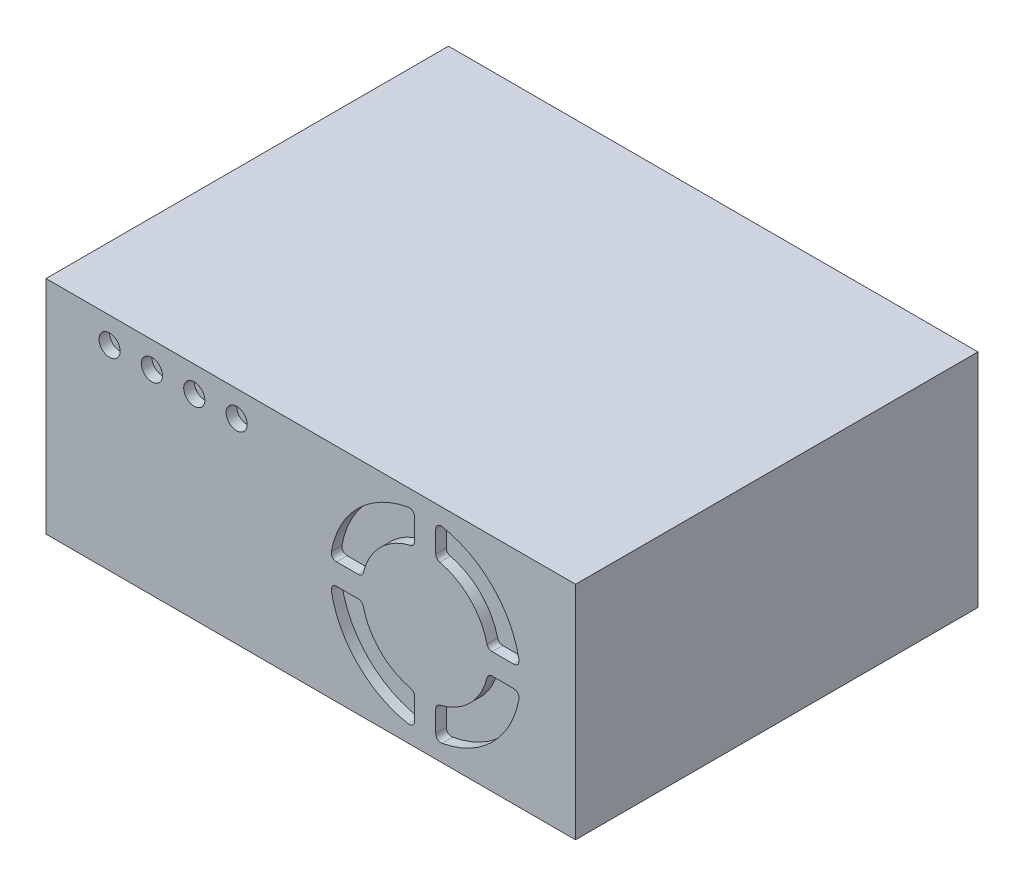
from build123d import *

# Parameters (mm, degrees)
SKETCH1_W           = 50
SKETCH1_H           = 38
BOSS_EXTRUDE1_DEPTH = 20.9
FAN_HOLES_DEPTH     = 1
SKETCH3_W           = 17
SKETCH3_H           = 4.9
CABLE_SLOT_DEPTH    = 2
SKETCH4_R           = 1
HOLES_DEPTH         = 1


with BuildPart() as part:
    # Sketch1 → Boss-Extrude1 (new body)
    with BuildSketch(Plane(origin=(0, 0, 0), x_dir=(1, 0, 0), z_dir=(0, 1, 0))):
        with Locations((25, 19)):
            Rectangle(SKETCH1_W, SKETCH1_H)
    extrude(amount=BOSS_EXTRUDE1_DEPTH)

    # Sketch2 → Fan holes (cut)
    with BuildSketch(Plane.XY):
        with BuildLine():
            Line((42.12455532, 11.45), (44.166600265, 11.45))
            ThreePointArc((44.166600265, 11.45), (44.55008276, 11.629155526), (44.658753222, 12.038235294))
            ThreePointArc((44.658753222, 12.038235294), (42.163961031, 16.813961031), (37.388235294, 19.308753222))
            ThreePointArc((37.388235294, 19.308753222), (36.979155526, 19.20008276), (36.8, 18.816600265))
            Line((36.8, 18.816600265), (36.8, 16.77455532))
            ThreePointArc((36.8, 16.77455532), (36.90776773, 16.464468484), (37.184615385, 16.288051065))
            ThreePointArc((37.184615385, 16.288051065), (40.042640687, 14.692640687), (41.638051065, 11.834615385))
            ThreePointArc((41.638051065, 11.834615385), (41.814468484, 11.55776773), (42.12455532, 11.45))
        make_face()
        with BuildLine():
            Line((34.8, 18.816600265), (34.8, 16.77455532))
            ThreePointArc((34.8, 16.77455532), (34.69223227, 16.464468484), (34.415384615, 16.288051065))
            ThreePointArc((34.415384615, 16.288051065), (31.557359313, 14.692640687), (29.961948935, 11.834615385))
            ThreePointArc((29.961948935, 11.834615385), (29.785531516, 11.55776773), (29.47544468, 11.45))
            Line((29.47544468, 11.45), (27.433399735, 11.45))
            ThreePointArc((27.433399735, 11.45), (27.04991724, 11.629155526), (26.941246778, 12.038235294))
            ThreePointArc((26.941246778, 12.038235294), (29.436038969, 16.813961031), (34.211764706, 19.308753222))
            ThreePointArc((34.211764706, 19.308753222), (34.620844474, 19.20008276), (34.8, 18.816600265))
        make_face()
        with BuildLine():
            Line((27.433399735, 9.45), (29.47544468, 9.45))
            ThreePointArc((29.47544468, 9.45), (29.785531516, 9.34223227), (29.961948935, 9.065384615))
            ThreePointArc((29.961948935, 9.065384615), (31.557359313, 6.207359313), (34.415384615, 4.611948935))
            ThreePointArc((34.415384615, 4.611948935), (34.69223227, 4.435531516), (34.8, 4.12544468))
            Line((34.8, 4.12544468), (34.8, 2.083399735))
            ThreePointArc((34.8, 2.083399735), (34.620844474, 1.69991724), (34.211764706, 1.591246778))
            ThreePointArc((34.211764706, 1.591246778), (29.436038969, 4.086038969), (26.941246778, 8.861764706))
            ThreePointArc((26.941246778, 8.861764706), (27.04991724, 9.270844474), (27.433399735, 9.45))
        make_face()
        with BuildLine():
            Line((42.12455532, 9.45), (44.166600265, 9.45))
            ThreePointArc((44.166600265, 9.45), (44.55008276, 9.270844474), (44.658753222, 8.861764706))
            ThreePointArc((44.658753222, 8.861764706), (42.163961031, 4.086038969), (37.388235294, 1.591246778))
            ThreePointArc((37.388235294, 1.591246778), (36.979155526, 1.69991724), (36.8, 2.083399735))
            Line((36.8, 2.083399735), (36.8, 4.12544468))
            ThreePointArc((36.8, 4.12544468), (36.90776773, 4.435531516), (37.184615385, 4.611948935))
            ThreePointArc((37.184615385, 4.611948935), (40.042640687, 6.207359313), (41.638051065, 9.065384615))
            ThreePointArc((41.638051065, 9.065384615), (41.814468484, 9.34223227), (42.12455532, 9.45))
        make_face()
    extrude(amount=-FAN_HOLES_DEPTH, mode=Mode.SUBTRACT)

    # Sketch3 → Cable slot (cut)
    with BuildSketch(Plane(origin=(0, 0, -38), x_dir=(-1, 0, 0), z_dir=(0, 0, -1))):
        with Locations((-36, 10.45)):
            Rectangle(SKETCH3_W, SKETCH3_H)
    extrude(amount=-CABLE_SLOT_DEPTH, mode=Mode.SUBTRACT)

    # Sketch4 → Holes (cut)
    with BuildSketch(Plane.XY):
        with Locations((6, 18.45)):
            Circle(SKETCH4_R)
        with Locations((10, 18.45)):
            Circle(SKETCH4_R)
        with Locations((14, 18.45)):
            Circle(SKETCH4_R)
        with Locations((18, 18.45)):
            Circle(SKETCH4_R)
    extrude(amount=-HOLES_DEPTH, mode=Mode.SUBTRACT)


solid = part.part
